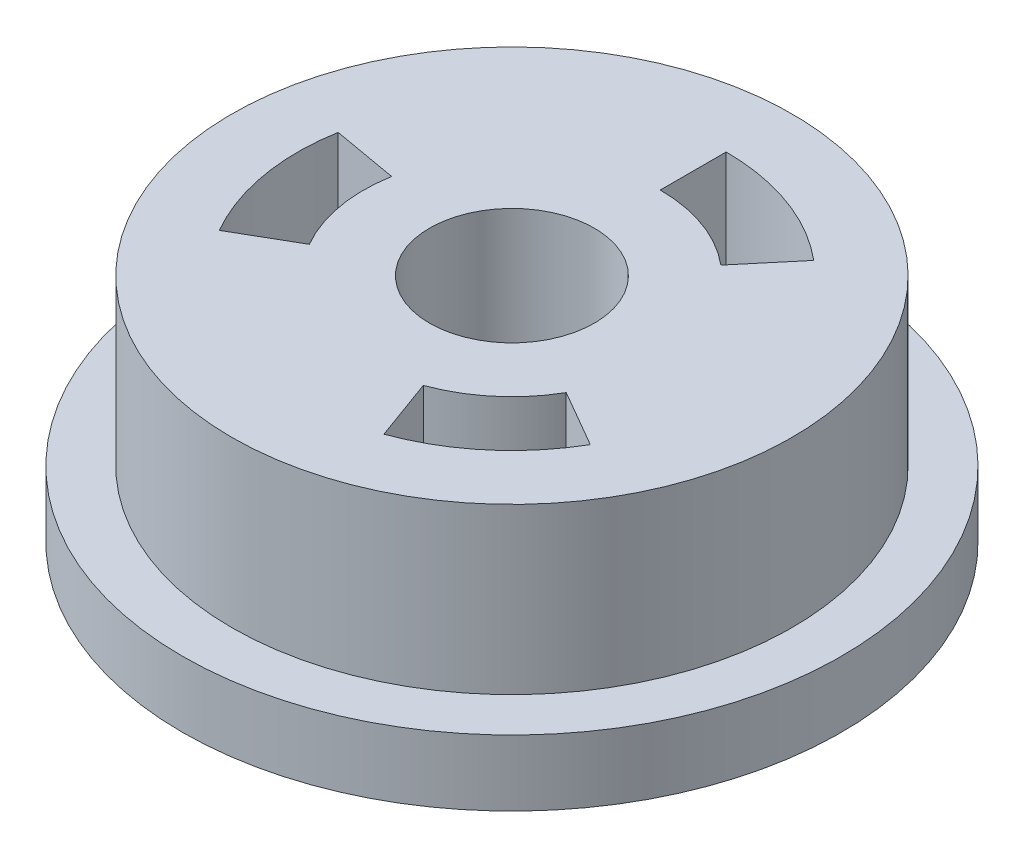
from build123d import *

# Parameters (mm, degrees)
SKETCH_1_R               = 10
EXTRUDE_2_DEPTH          = 2
SKETCH_2_R               = 8.5
EXTRUDE_3_DEPTH          = 5
CUT_EXTRUDE_1_DEPTH      = 3
PATTERN_CIRCULAR_3_COUNT = 3
SKETCH_4_R               = 2.5
CUT_EXTRUDE_2_DEPTH      = 16.779733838


with BuildPart() as part:
    # Sketch 1 → Extrude 2 (new body)
    with BuildSketch(Plane(origin=(0, 0, 0), x_dir=(1, 0, 0), z_dir=(0, 1, 0))):
        with Locations(Location((0, 0, 0), (0, 0, 270))):
            Circle(SKETCH_1_R)
    extrude(amount=-EXTRUDE_2_DEPTH)

    # Sketch 2 → Extrude 3 (add)
    with BuildSketch(Plane(origin=(0, 0, 0), x_dir=(1, 0, 0), z_dir=(0, 1, 0))):
        with Locations(Location((0, 0, 0), (0, 0, 270))):
            Circle(SKETCH_2_R)
    extrude(amount=EXTRUDE_3_DEPTH)

    # Sketch 3 → Cut-Extrude 1 (cut)
    with BuildSketch(Plane(origin=(0, 5, 0), x_dir=(1, 0, 0), z_dir=(0, 1, 0))):
        with BuildLine():
            Line((0, 6.5), (0, 4.5))
            ThreePointArc((0, 4.5), (1.539090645, 4.228616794), (2.892544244, 3.447199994))
            Line((2.892544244, 3.447199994), (4.178119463, 4.97928888))
            ThreePointArc((4.178119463, 4.97928888), (2.223130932, 6.108002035), (0, 6.5))
        make_face()
    cut_extrude_1 = extrude(amount=-CUT_EXTRUDE_1_DEPTH, mode=Mode.SUBTRACT)

    # Pattern Circular 3: Cut-Extrude 1 ×3 about axis
    pattern_circular_3_axis = Axis((0, 0, 0), (0, 1, 0))
    for i in range(1, PATTERN_CIRCULAR_3_COUNT):
        add(cut_extrude_1.rotate(pattern_circular_3_axis, i * 360 / PATTERN_CIRCULAR_3_COUNT), mode=Mode.SUBTRACT)

    # Sketch 4 → Cut-Extrude 2 (cut, through all)
    with BuildSketch(Plane(origin=(0, 5, 0), x_dir=(1, 0, 0), z_dir=(0, 1, 0))):
        with Locations(Location((0, 0, 0), (0, 0, 270))):
            Circle(SKETCH_4_R)
    extrude(amount=-CUT_EXTRUDE_2_DEPTH, mode=Mode.SUBTRACT)


solid = part.part
